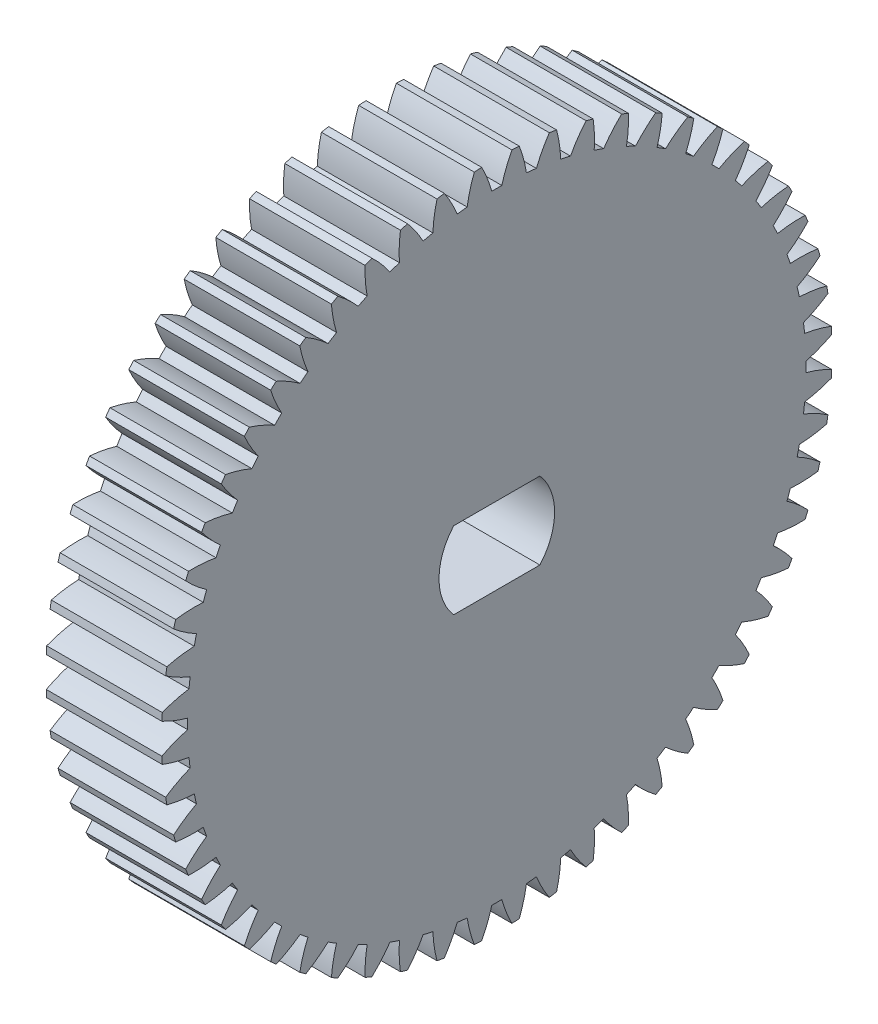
from build123d import *

# Parameters (mm, degrees)
BASPROSKE_W      = 6
BASPROSKE_H      = 17.4
TOOTHCUT_DEPTH   = 26.328245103
TEETHCUTS_COUNT  = 56
ESQUISSE1_R      = 5
EXTRUSION1_DEPTH = 1
BORE_DEPTH       = 50.0000508


with BuildPart() as part:
    # BasProSke → Base-Revolve (revolve)
    with BuildSketch(Plane(origin=(0, 0, 0), x_dir=(1, 0, 0), z_dir=(0, 1, 0)), mode=Mode.PRIVATE) as base_revolve_sk:
        with Locations((3, 8.7)):
            Rectangle(BASPROSKE_W, BASPROSKE_H)
    revolve(base_revolve_sk.sketch.rotate(Axis((-10, 0, 0), (1, 0, 0)), 180), axis=Axis((-10, 0, 0), (1, 0, 0)))

    # TooCutSke → ToothCut (cut, through all)
    with BuildSketch(Plane(origin=(0, 0, 0), x_dir=(0, 0, -1), z_dir=(1, 0, 0))):
        with BuildLine():
            ThreePointArc((0.259936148, 16.046894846), (0, 16.049), (-0.259936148, 16.046894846))
            ThreePointArc((-0.259936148, 16.046894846), (-0.491244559, 16.74168114), (-0.796778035, 17.407174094))
            ThreePointArc((-0.796778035, 17.407174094), (0, 17.4254), (0.796778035, 17.407174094))
            ThreePointArc((0.796778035, 17.407174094), (0.491244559, 16.74168114), (0.259936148, 16.046894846))
        make_face()
    toothcut = extrude(amount=TOOTHCUT_DEPTH, mode=Mode.SUBTRACT)

    # TeethCuts: ToothCut ×56 about axis
    teethcuts_axis = Axis((0, 0, 0), (1, 0, 0))
    for i in range(1, TEETHCUTS_COUNT):
        add(toothcut.rotate(teethcuts_axis, i * 360 / TEETHCUTS_COUNT), mode=Mode.SUBTRACT)

    # Esquisse1 → Extrusion1 (add)
    with BuildSketch(Plane(origin=(0, 0, 0), x_dir=(0, 0, -1), z_dir=(1, 0, 0))):
        Circle(ESQUISSE1_R)
    extrude(amount=-EXTRUSION1_DEPTH)

    # BorSke → Bore (cut, symmetric)
    with BuildSketch(Plane(origin=(0, 0, 0), x_dir=(0, 0, -1), z_dir=(1, 0, 0))):
        with BuildLine():
            Line((-2.236067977, 2), (2.236067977, 2))
            ThreePointArc((2.236067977, 2), (3, 0), (2.236067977, -2))
            Line((2.236067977, -2), (-2.236067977, -2))
            ThreePointArc((-2.236067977, -2), (-3, 0), (-2.236067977, 2))
        make_face()
    extrude(amount=BORE_DEPTH, both=True, mode=Mode.SUBTRACT)


solid = part.part
